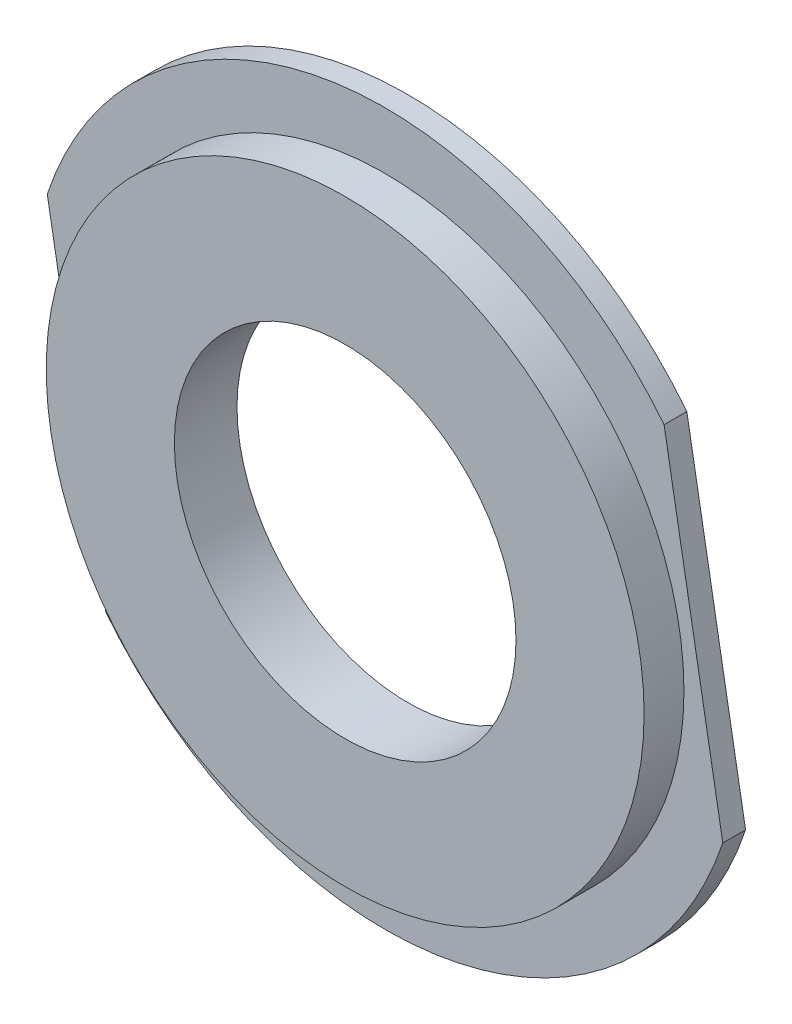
ISO-10303-21;
HEADER;
FILE_DESCRIPTION(('STEP AP214'),'2;1');
FILE_NAME('part.step','',(''),(''),'','','');
FILE_SCHEMA(('AUTOMOTIVE_DESIGN { 1 0 10303 214 1 1 1 1 }'));
ENDSEC;
DATA;
#1=APPLICATION_CONTEXT('core data for automotive mechanical design processes');
#2=APPLICATION_PROTOCOL_DEFINITION('international standard','automotive_design',2000,#1);
#3=PRODUCT_CONTEXT('',#1,'mechanical');
#4=PRODUCT('Part','Part','',(#3));
#5=PRODUCT_RELATED_PRODUCT_CATEGORY('part','',(#4));
#6=PRODUCT_DEFINITION_FORMATION('','',#4);
#7=PRODUCT_DEFINITION_CONTEXT('part definition',#1,'design');
#8=PRODUCT_DEFINITION('design','',#6,#7);
#9=PRODUCT_DEFINITION_SHAPE('','',#8);
#10=(LENGTH_UNIT() NAMED_UNIT(*) SI_UNIT(.MILLI.,.METRE.));
#11=(NAMED_UNIT(*) PLANE_ANGLE_UNIT() SI_UNIT($,.RADIAN.));
#12=(NAMED_UNIT(*) SI_UNIT($,.STERADIAN.) SOLID_ANGLE_UNIT());
#13=UNCERTAINTY_MEASURE_WITH_UNIT(LENGTH_MEASURE(1.E-05),#10,'distance_accuracy_value','');
#14=(GEOMETRIC_REPRESENTATION_CONTEXT(3) GLOBAL_UNCERTAINTY_ASSIGNED_CONTEXT((#13)) GLOBAL_UNIT_ASSIGNED_CONTEXT((#10,
#11,#12)) REPRESENTATION_CONTEXT('',''));
#15=CARTESIAN_POINT('',(0.,0.,0.));
#16=DIRECTION('',(0.,0.,1.));
#17=DIRECTION('',(1.,0.,0.));
#18=AXIS2_PLACEMENT_3D('',#15,#16,#17);
#19=CARTESIAN_POINT('',(0.,0.,8.));
#20=DIRECTION('',(0.,0.,1.));
#21=DIRECTION('',(1.,0.,0.));
#22=AXIS2_PLACEMENT_3D('',#19,#20,#21);
#23=CYLINDRICAL_SURFACE('',#22,105.);
#24=CARTESIAN_POINT('',(0.,0.,8.));
#25=DIRECTION('',(0.,0.,1.));
#26=DIRECTION('',(1.,0.,0.));
#27=AXIS2_PLACEMENT_3D('',#24,#25,#26);
#28=CIRCLE('',#27,105.);
#29=CARTESIAN_POINT('',(105.,0.,8.));
#30=VERTEX_POINT('',#29);
#31=EDGE_CURVE('E20',#30,#30,#28,.T.);
#32=ORIENTED_EDGE('',*,*,#31,.T.);
#33=EDGE_LOOP('',(#32));
#34=FACE_BOUND('',#33,.T.);
#35=CARTESIAN_POINT('',(0.,0.,22.));
#36=DIRECTION('',(0.,0.,1.));
#37=DIRECTION('',(1.,0.,0.));
#38=AXIS2_PLACEMENT_3D('',#35,#36,#37);
#39=CIRCLE('',#38,105.);
#40=CARTESIAN_POINT('',(105.,0.,22.));
#41=VERTEX_POINT('',#40);
#42=EDGE_CURVE('E84',#41,#41,#39,.F.);
#43=ORIENTED_EDGE('',*,*,#42,.T.);
#44=EDGE_LOOP('',(#43));
#45=FACE_BOUND('',#44,.T.);
#46=ADVANCED_FACE('F16',(#34,#45),#23,.T.);
#47=CARTESIAN_POINT('',(0.,0.,8.));
#48=DIRECTION('',(0.,0.,-1.));
#49=DIRECTION('',(-1.,0.,0.));
#50=AXIS2_PLACEMENT_3D('',#47,#48,#49);
#51=PLANE('',#50);
#52=ORIENTED_EDGE('',*,*,#31,.F.);
#53=EDGE_LOOP('',(#52));
#54=FACE_BOUND('',#53,.T.);
#55=CARTESIAN_POINT('',(0.,0.,8.));
#56=DIRECTION('',(0.,0.,1.));
#57=DIRECTION('',(1.,0.,0.));
#58=AXIS2_PLACEMENT_3D('',#55,#56,#57);
#59=CIRCLE('',#58,125.);
#60=CARTESIAN_POINT('',(-118.639354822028,39.3662734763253,8.));
#61=VERTEX_POINT('',#60);
#62=CARTESIAN_POINT('',(98.0176592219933,77.5727947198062,8.));
#63=VERTEX_POINT('',#62);
#64=EDGE_CURVE('E72',#61,#63,#59,.F.);
#65=ORIENTED_EDGE('',*,*,#64,.F.);
#66=DIRECTION('',(-0.173666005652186,0.984804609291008,0.));
#67=VECTOR('',#66,1.);
#68=CARTESIAN_POINT('',(-118.639354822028,39.3662734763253,8.));
#69=LINE('',#68,#67);
#70=CARTESIAN_POINT('',(-98.0176592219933,-77.5727947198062,8.));
#71=VERTEX_POINT('',#70);
#72=EDGE_CURVE('E69',#61,#71,#69,.F.);
#73=ORIENTED_EDGE('',*,*,#72,.T.);
#74=CARTESIAN_POINT('',(0.,0.,8.));
#75=DIRECTION('',(0.,0.,1.));
#76=DIRECTION('',(1.,0.,0.));
#77=AXIS2_PLACEMENT_3D('',#74,#75,#76);
#78=CIRCLE('',#77,125.);
#79=CARTESIAN_POINT('',(118.639354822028,-39.3662734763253,8.));
#80=VERTEX_POINT('',#79);
#81=EDGE_CURVE('E59',#80,#71,#78,.F.);
#82=ORIENTED_EDGE('',*,*,#81,.F.);
#83=DIRECTION('',(0.173666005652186,-0.984804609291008,0.));
#84=VECTOR('',#83,1.);
#85=CARTESIAN_POINT('',(118.639354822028,-39.3662734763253,8.));
#86=LINE('',#85,#84);
#87=EDGE_CURVE('E54',#80,#63,#86,.F.);
#88=ORIENTED_EDGE('',*,*,#87,.T.);
#89=EDGE_LOOP('',(#65,#73,#82,#88));
#90=FACE_BOUND('',#89,.T.);
#91=ADVANCED_FACE('F70',(#54,#90),#51,.F.);
#92=CARTESIAN_POINT('',(0.,0.,22.));
#93=DIRECTION('',(0.,0.,-1.));
#94=DIRECTION('',(-1.,0.,0.));
#95=AXIS2_PLACEMENT_3D('',#92,#93,#94);
#96=PLANE('',#95);
#97=CARTESIAN_POINT('',(0.,0.,22.));
#98=DIRECTION('',(0.,0.,1.));
#99=DIRECTION('',(1.,0.,0.));
#100=AXIS2_PLACEMENT_3D('',#97,#98,#99);
#101=CIRCLE('',#100,60.);
#102=CARTESIAN_POINT('',(60.,0.,22.));
#103=VERTEX_POINT('',#102);
#104=EDGE_CURVE('E91',#103,#103,#101,.F.);
#105=ORIENTED_EDGE('',*,*,#104,.T.);
#106=EDGE_LOOP('',(#105));
#107=FACE_BOUND('',#106,.T.);
#108=ORIENTED_EDGE('',*,*,#42,.F.);
#109=EDGE_LOOP('',(#108));
#110=FACE_BOUND('',#109,.T.);
#111=ADVANCED_FACE('F102',(#107,#110),#96,.F.);
#112=CARTESIAN_POINT('',(118.639354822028,-39.3662734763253,0.));
#113=DIRECTION('',(-0.984804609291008,-0.173666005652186,0.));
#114=DIRECTION('',(0.173666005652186,-0.984804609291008,0.));
#115=AXIS2_PLACEMENT_3D('',#112,#113,#114);
#116=PLANE('',#115);
#117=DIRECTION('',(0.,0.,1.));
#118=VECTOR('',#117,1.);
#119=CARTESIAN_POINT('',(118.639354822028,-39.3662734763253,0.));
#120=LINE('',#119,#118);
#121=CARTESIAN_POINT('',(118.639354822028,-39.3662734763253,0.));
#122=VERTEX_POINT('',#121);
#123=EDGE_CURVE('E65',#122,#80,#120,.T.);
#124=ORIENTED_EDGE('',*,*,#123,.F.);
#125=DIRECTION('',(0.173666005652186,-0.984804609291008,0.));
#126=VECTOR('',#125,1.);
#127=CARTESIAN_POINT('',(98.0176592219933,77.5727947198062,0.));
#128=LINE('',#127,#126);
#129=CARTESIAN_POINT('',(98.0176592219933,77.5727947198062,0.));
#130=VERTEX_POINT('',#129);
#131=EDGE_CURVE('E90',#130,#122,#128,.T.);
#132=ORIENTED_EDGE('',*,*,#131,.F.);
#133=DIRECTION('',(0.,0.,1.));
#134=VECTOR('',#133,1.);
#135=CARTESIAN_POINT('',(98.0176592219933,77.5727947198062,0.));
#136=LINE('',#135,#134);
#137=EDGE_CURVE('E73',#63,#130,#136,.F.);
#138=ORIENTED_EDGE('',*,*,#137,.F.);
#139=ORIENTED_EDGE('',*,*,#87,.F.);
#140=EDGE_LOOP('',(#124,#132,#138,#139));
#141=FACE_BOUND('',#140,.T.);
#142=ADVANCED_FACE('F107',(#141),#116,.F.);
#143=CARTESIAN_POINT('',(0.,0.,0.));
#144=DIRECTION('',(0.,0.,1.));
#145=DIRECTION('',(1.,0.,0.));
#146=AXIS2_PLACEMENT_3D('',#143,#144,#145);
#147=CYLINDRICAL_SURFACE('',#146,125.);
#148=DIRECTION('',(0.,0.,1.));
#149=VECTOR('',#148,1.);
#150=CARTESIAN_POINT('',(-98.0176592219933,-77.5727947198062,0.));
#151=LINE('',#150,#149);
#152=CARTESIAN_POINT('',(-98.0176592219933,-77.5727947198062,0.));
#153=VERTEX_POINT('',#152);
#154=EDGE_CURVE('E64',#71,#153,#151,.F.);
#155=ORIENTED_EDGE('',*,*,#154,.T.);
#156=CARTESIAN_POINT('',(0.,0.,0.));
#157=DIRECTION('',(0.,0.,1.));
#158=DIRECTION('',(1.,0.,0.));
#159=AXIS2_PLACEMENT_3D('',#156,#157,#158);
#160=CIRCLE('',#159,125.);
#161=EDGE_CURVE('E88',#122,#153,#160,.F.);
#162=ORIENTED_EDGE('',*,*,#161,.F.);
#163=ORIENTED_EDGE('',*,*,#123,.T.);
#164=ORIENTED_EDGE('',*,*,#81,.T.);
#165=EDGE_LOOP('',(#155,#162,#163,#164));
#166=FACE_BOUND('',#165,.T.);
#167=ADVANCED_FACE('F61',(#166),#147,.T.);
#168=CARTESIAN_POINT('',(-118.639354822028,39.3662734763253,0.));
#169=DIRECTION('',(0.984804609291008,0.173666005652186,0.));
#170=DIRECTION('',(-0.173666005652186,0.984804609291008,0.));
#171=AXIS2_PLACEMENT_3D('',#168,#169,#170);
#172=PLANE('',#171);
#173=DIRECTION('',(0.,0.,1.));
#174=VECTOR('',#173,1.);
#175=CARTESIAN_POINT('',(-118.639354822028,39.3662734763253,0.));
#176=LINE('',#175,#174);
#177=CARTESIAN_POINT('',(-118.639354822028,39.3662734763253,0.));
#178=VERTEX_POINT('',#177);
#179=EDGE_CURVE('E35',#178,#61,#176,.T.);
#180=ORIENTED_EDGE('',*,*,#179,.F.);
#181=DIRECTION('',(-0.173666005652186,0.984804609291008,0.));
#182=VECTOR('',#181,1.);
#183=CARTESIAN_POINT('',(-98.0176592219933,-77.5727947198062,0.));
#184=LINE('',#183,#182);
#185=EDGE_CURVE('E77',#153,#178,#184,.T.);
#186=ORIENTED_EDGE('',*,*,#185,.F.);
#187=ORIENTED_EDGE('',*,*,#154,.F.);
#188=ORIENTED_EDGE('',*,*,#72,.F.);
#189=EDGE_LOOP('',(#180,#186,#187,#188));
#190=FACE_BOUND('',#189,.T.);
#191=ADVANCED_FACE('F75',(#190),#172,.F.);
#192=CARTESIAN_POINT('',(0.,0.,0.));
#193=DIRECTION('',(0.,0.,1.));
#194=DIRECTION('',(1.,0.,0.));
#195=AXIS2_PLACEMENT_3D('',#192,#193,#194);
#196=CYLINDRICAL_SURFACE('',#195,125.);
#197=ORIENTED_EDGE('',*,*,#179,.T.);
#198=ORIENTED_EDGE('',*,*,#64,.T.);
#199=ORIENTED_EDGE('',*,*,#137,.T.);
#200=CARTESIAN_POINT('',(0.,0.,0.));
#201=DIRECTION('',(0.,0.,1.));
#202=DIRECTION('',(1.,0.,0.));
#203=AXIS2_PLACEMENT_3D('',#200,#201,#202);
#204=CIRCLE('',#203,125.);
#205=EDGE_CURVE('E26',#178,#130,#204,.F.);
#206=ORIENTED_EDGE('',*,*,#205,.F.);
#207=EDGE_LOOP('',(#197,#198,#199,#206));
#208=FACE_BOUND('',#207,.T.);
#209=ADVANCED_FACE('F117',(#208),#196,.T.);
#210=CARTESIAN_POINT('',(0.,0.,0.));
#211=DIRECTION('',(0.,0.,1.));
#212=DIRECTION('',(1.,0.,0.));
#213=AXIS2_PLACEMENT_3D('',#210,#211,#212);
#214=CYLINDRICAL_SURFACE('',#213,60.);
#215=ORIENTED_EDGE('',*,*,#104,.F.);
#216=EDGE_LOOP('',(#215));
#217=FACE_BOUND('',#216,.T.);
#218=CARTESIAN_POINT('',(0.,0.,0.));
#219=DIRECTION('',(0.,0.,1.));
#220=DIRECTION('',(1.,0.,0.));
#221=AXIS2_PLACEMENT_3D('',#218,#219,#220);
#222=CIRCLE('',#221,60.);
#223=CARTESIAN_POINT('',(60.,0.,0.));
#224=VERTEX_POINT('',#223);
#225=EDGE_CURVE('E10',#224,#224,#222,.T.);
#226=ORIENTED_EDGE('',*,*,#225,.F.);
#227=EDGE_LOOP('',(#226));
#228=FACE_BOUND('',#227,.T.);
#229=ADVANCED_FACE('F113',(#217,#228),#214,.F.);
#230=CARTESIAN_POINT('',(0.,0.,0.));
#231=DIRECTION('',(0.,0.,-1.));
#232=DIRECTION('',(-1.,0.,0.));
#233=AXIS2_PLACEMENT_3D('',#230,#231,#232);
#234=PLANE('',#233);
#235=ORIENTED_EDGE('',*,*,#225,.T.);
#236=EDGE_LOOP('',(#235));
#237=FACE_BOUND('',#236,.T.);
#238=ORIENTED_EDGE('',*,*,#185,.T.);
#239=ORIENTED_EDGE('',*,*,#205,.T.);
#240=ORIENTED_EDGE('',*,*,#131,.T.);
#241=ORIENTED_EDGE('',*,*,#161,.T.);
#242=EDGE_LOOP('',(#238,#239,#240,#241));
#243=FACE_BOUND('',#242,.T.);
#244=ADVANCED_FACE('F18',(#237,#243),#234,.T.);
#245=CLOSED_SHELL('',(#46,#91,#111,#142,#167,#191,#209,#229,#244));
#246=MANIFOLD_SOLID_BREP('B1',#245);
#247=ADVANCED_BREP_SHAPE_REPRESENTATION('',(#18,#246),#14);
#248=SHAPE_DEFINITION_REPRESENTATION(#9,#247);
ENDSEC;
END-ISO-10303-21;
